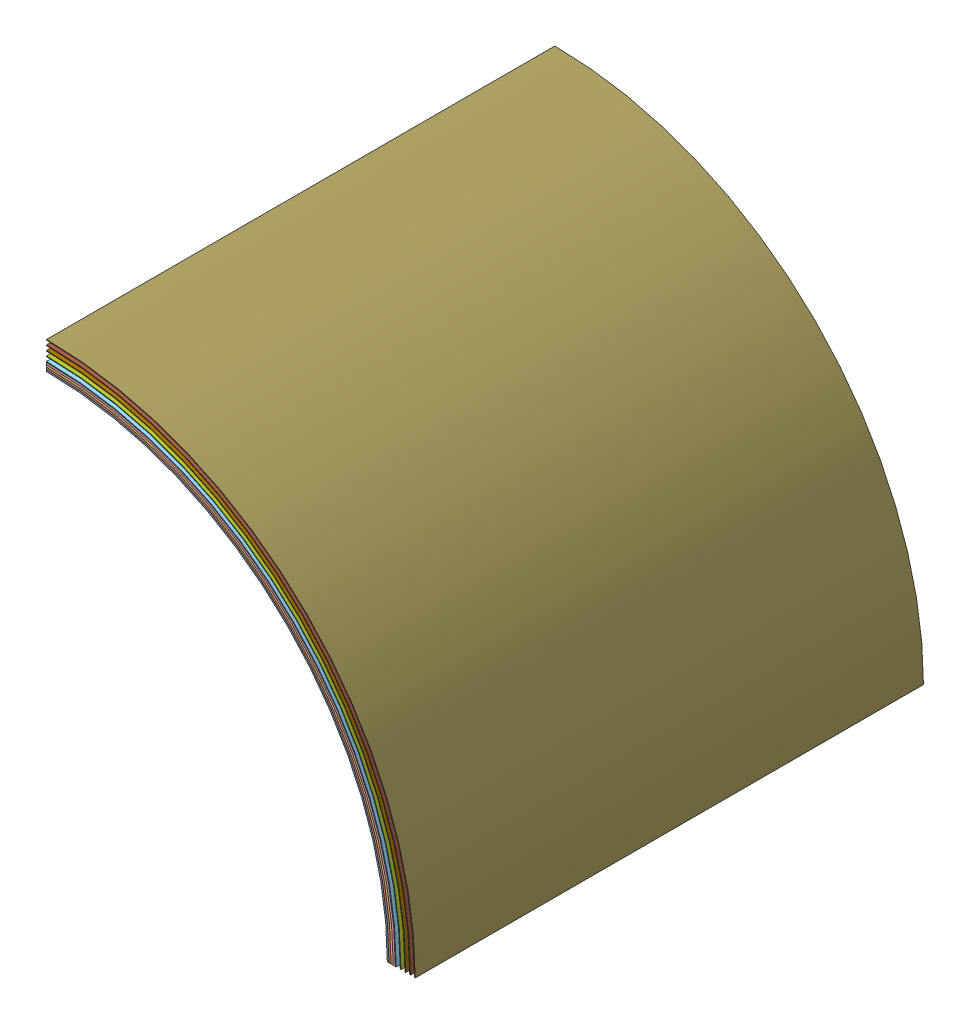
SolidWorks assembly NASA RASC-AL Inner-Wall and MLI and Whipple Shiled PRTYv3.SLDASM, configuration Default (file format 13000). Lengths in mm.
Overall size (2176 2176 3000).
14 component instances, 12 part files, 3 mates.
Components (placement in the parent):
- NASA RASC-AL MLI and Inner Wall PRTYv3-1: NASA RASC-AL MLI and Inner Wall PRTYv3.SLDASM [Default] at (369.5626 -211.3035 205.8631) size (2059 2059 3000)
  - NASA RASC-AL Internal Wall PRTYv2-1: NASA RASC-AL Internal Wall PRTYv2.SLDPRT [Default] at (-319.7091 782.2821 3594.5266) size (2021.5 2021.5 3000)
  - NASA RASC-AL MLI Layer 1 PRTYv3-1: NASA RASC-AL MLI Layer 1 PRTYv3.SLDPRT [Default] at (-319.7091 782.2821 3594.5266) size (2034 2034 3000)
  - NASA RASC-AL MLI Layer 2 PRTYv3-1: NASA RASC-AL MLI Layer 2 PRTYv3.SLDPRT [Default] at (-319.7091 782.2821 3594.5266) size (2046.5 2046.5 3000)
  - NASA RASC-AL MLI Layer 3 PRTYv3-1: NASA RASC-AL MLI Layer 3 PRTYv3.SLDPRT [Default] at (-319.7091 782.2821 3594.5266) size (2059 2059 3000)
- NASA RASC-AL Whipple Shiled PRTYv3-1: NASA RASC-AL Whipple Shiled PRTYv3.SLDASM [Default] at (315.8374 2.4162 -165.287) size (2176 2176 3000)
  - NASA RASC-AL Whipple Shield Rear Wall PRTYv3-1: NASA RASC-AL Whipple Shield Rear Wall PRTYv3.SLDPRT [Default] at (-265.9839 568.5624 3965.6767) size (2064 2064 3000)
  - NASA RASC-AL Whipple Shield Kevlar 1 PRTYv3-1: NASA RASC-AL Whipple Shield Kevlar 1 PRTYv3.SLDPRT [Default] at (-265.9839 568.5624 3965.6767) size (2090 2090 3000)
  - NASA RASC-AL Whipple Shield Nextol 1 PRTYv3-2: NASA RASC-AL Whipple Shield Nextol 1 PRTYv3.SLDPRT [Default] at (-265.9839 568.5624 3965.6767) size (2092 2092 3000)
  - NASA RASC-AL Whipple Shield Kevlar 2 PRTYv3-1: NASA RASC-AL Whipple Shield Kevlar 2 PRTYv3.SLDPRT [Default] at (-265.9839 568.5624 3965.6767) size (2118 2118 3000)
  - NASA RASC-AL Whipple Shield Nextol 2 PRTYv3-1: NASA RASC-AL Whipple Shield Nextol 2 PRTYv3.SLDPRT [Default] at (-265.9839 568.5624 3965.6767) size (2120 2120 3000)
  - NASA RASC-AL Whipple Shield Kevlar 3 PRTYv3-1: NASA RASC-AL Whipple Shield Kevlar 3 PRTYv3.SLDPRT [Default] at (-265.9839 568.5624 3965.6767) size (2146 2146 3000)
  - NASA RASC-AL Whipple Shield Nextol 3 PRTYv3-1: NASA RASC-AL Whipple Shield Nextol 3 PRTYv3.SLDPRT [Default] at (-265.9839 568.5624 3965.6767) size (2148 2148 3000)
  - NASA RASC-AL Whipple Shield Front Bummper PRTYv3-1: NASA RASC-AL Whipple Shield Front Bummper PRTYv3.SLDPRT [Default] at (-265.9839 568.5624 3965.6767) size (2176 2176 3000)
Mates (geometry in assembly coordinates):
- Concentric1: concentric aligned: cylinder of NASA RASC-AL MLI and Inner Wall PRTYv3-1/NASA RASC-AL MLI Layer 3 PRTYv3-1 through (49.8535 570.9786 800.3897) axis (0 0 1) radius 2059; cylinder of NASA RASC-AL Whipple Shiled PRTYv3-1/NASA RASC-AL Whipple Shield Rear Wall PRTYv3-1 through (49.8535 570.9786 800.3897) axis (0 0 1) radius 2059
- Coincident1: coincident aligned: plane of NASA RASC-AL MLI and Inner Wall PRTYv3-1/NASA RASC-AL MLI Layer 3 PRTYv3-1 through (49.8535 2629.9786 800.3897) normal (-1 0 0); plane of NASA RASC-AL Whipple Shiled PRTYv3-1/NASA RASC-AL Whipple Shield Rear Wall PRTYv3-1 through (49.8535 2634.9786 800.3897) normal (-1 0 0)
- Coincident2: coincident aligned: plane of NASA RASC-AL MLI and Inner Wall PRTYv3-1/NASA RASC-AL MLI Layer 3 PRTYv3-1 through (49.8535 570.9786 3800.3897) normal (0 0 1); plane of NASA RASC-AL Whipple Shiled PRTYv3-1/NASA RASC-AL Whipple Shield Rear Wall PRTYv3-1 through (49.8535 570.9786 3800.3897) normal (0 0 1)
